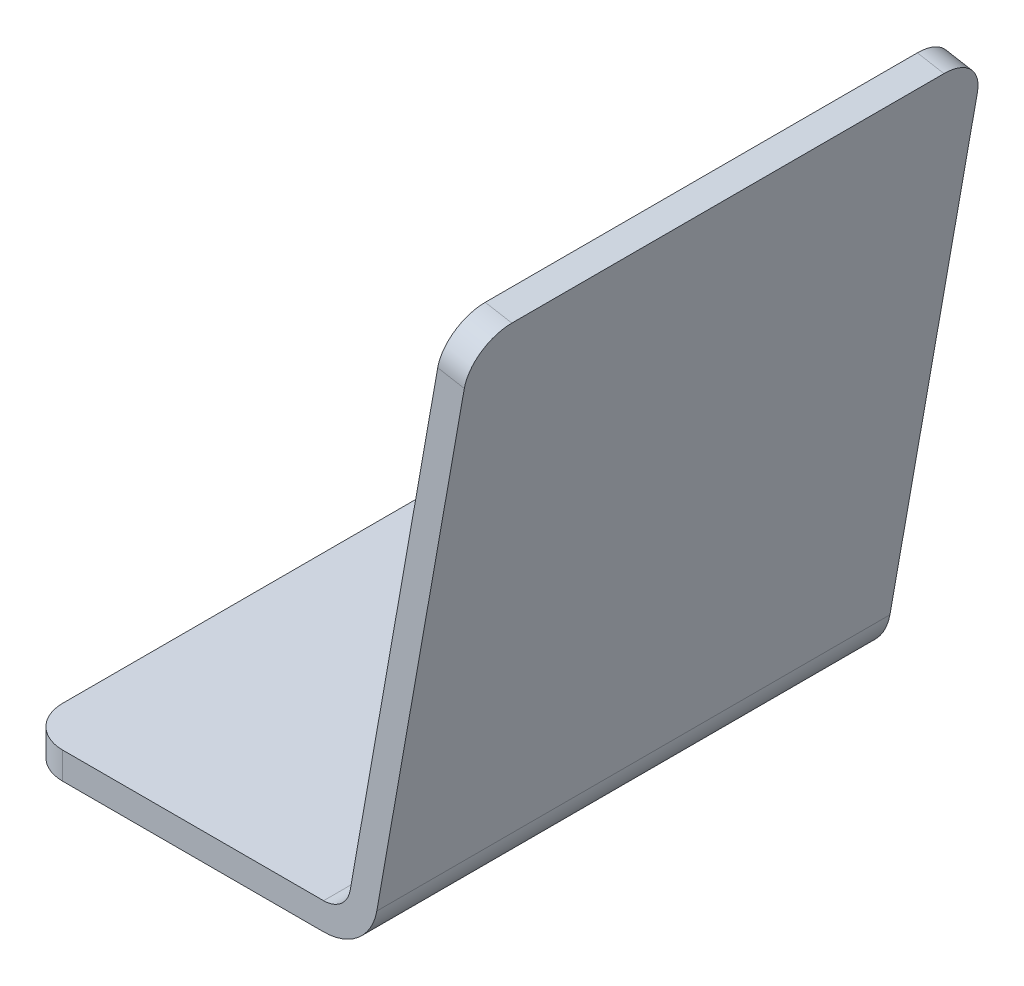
ISO-10303-21;
HEADER;
FILE_DESCRIPTION(('STEP AP214'),'2;1');
FILE_NAME('part.step','',(''),(''),'','','');
FILE_SCHEMA(('AUTOMOTIVE_DESIGN { 1 0 10303 214 1 1 1 1 }'));
ENDSEC;
DATA;
#1=APPLICATION_CONTEXT('core data for automotive mechanical design processes');
#2=APPLICATION_PROTOCOL_DEFINITION('international standard','automotive_design',2000,#1);
#3=PRODUCT_CONTEXT('',#1,'mechanical');
#4=PRODUCT('Part','Part','',(#3));
#5=PRODUCT_RELATED_PRODUCT_CATEGORY('part','',(#4));
#6=PRODUCT_DEFINITION_FORMATION('','',#4);
#7=PRODUCT_DEFINITION_CONTEXT('part definition',#1,'design');
#8=PRODUCT_DEFINITION('design','',#6,#7);
#9=PRODUCT_DEFINITION_SHAPE('','',#8);
#10=(LENGTH_UNIT() NAMED_UNIT(*) SI_UNIT(.MILLI.,.METRE.));
#11=(NAMED_UNIT(*) PLANE_ANGLE_UNIT() SI_UNIT($,.RADIAN.));
#12=(NAMED_UNIT(*) SI_UNIT($,.STERADIAN.) SOLID_ANGLE_UNIT());
#13=UNCERTAINTY_MEASURE_WITH_UNIT(LENGTH_MEASURE(1.E-05),#10,'distance_accuracy_value','');
#14=(GEOMETRIC_REPRESENTATION_CONTEXT(3) GLOBAL_UNCERTAINTY_ASSIGNED_CONTEXT((#13)) GLOBAL_UNIT_ASSIGNED_CONTEXT((#10,
#11,#12)) REPRESENTATION_CONTEXT('',''));
#15=CARTESIAN_POINT('',(0.,0.,0.));
#16=DIRECTION('',(0.,0.,1.));
#17=DIRECTION('',(1.,0.,0.));
#18=AXIS2_PLACEMENT_3D('',#15,#16,#17);
#19=CARTESIAN_POINT('',(26.2610317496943,1.30540728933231,38.));
#20=DIRECTION('',(-0.984807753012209,0.173648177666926,0.));
#21=DIRECTION('',(-0.173648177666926,-0.984807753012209,0.));
#22=AXIS2_PLACEMENT_3D('',#19,#20,#21);
#23=PLANE('',#22);
#24=DIRECTION('',(0.,0.,-1.));
#25=VECTOR('',#24,1.);
#26=CARTESIAN_POINT('',(33.2628389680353,41.0146292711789,38.));
#27=LINE('',#26,#25);
#28=CARTESIAN_POINT('',(33.2628389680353,41.0146292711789,35.));
#29=VERTEX_POINT('',#28);
#30=CARTESIAN_POINT('',(33.2628389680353,41.0146292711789,3.));
#31=VERTEX_POINT('',#30);
#32=EDGE_CURVE('E175',#29,#31,#27,.T.);
#33=ORIENTED_EDGE('',*,*,#32,.F.);
#34=CARTESIAN_POINT('',(32.7418944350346,38.0602060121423,35.));
#35=DIRECTION('',(-0.984807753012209,0.173648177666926,0.));
#36=DIRECTION('',(-0.173648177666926,-0.984807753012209,0.));
#37=AXIS2_PLACEMENT_3D('',#34,#35,#36);
#38=CIRCLE('',#37,3.);
#39=CARTESIAN_POINT('',(32.7418944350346,38.0602060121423,38.));
#40=VERTEX_POINT('',#39);
#41=EDGE_CURVE('E201',#29,#40,#38,.F.);
#42=ORIENTED_EDGE('',*,*,#41,.T.);
#43=DIRECTION('',(0.173648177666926,0.984807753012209,0.));
#44=VECTOR('',#43,1.);
#45=CARTESIAN_POINT('',(26.2610317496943,1.30540728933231,38.));
#46=LINE('',#45,#44);
#47=CARTESIAN_POINT('',(26.2610317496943,1.30540728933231,38.));
#48=VERTEX_POINT('',#47);
#49=EDGE_CURVE('E149',#48,#40,#46,.T.);
#50=ORIENTED_EDGE('',*,*,#49,.F.);
#51=DIRECTION('',(0.,0.,-1.));
#52=VECTOR('',#51,1.);
#53=CARTESIAN_POINT('',(26.2610317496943,1.30540728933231,38.));
#54=LINE('',#53,#52);
#55=CARTESIAN_POINT('',(26.2610317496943,1.30540728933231,0.));
#56=VERTEX_POINT('',#55);
#57=EDGE_CURVE('E161',#48,#56,#54,.T.);
#58=ORIENTED_EDGE('',*,*,#57,.T.);
#59=DIRECTION('',(0.173648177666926,0.984807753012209,0.));
#60=VECTOR('',#59,1.);
#61=CARTESIAN_POINT('',(26.2610317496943,1.30540728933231,0.));
#62=LINE('',#61,#60);
#63=CARTESIAN_POINT('',(32.7418944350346,38.0602060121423,0.));
#64=VERTEX_POINT('',#63);
#65=EDGE_CURVE('E133',#56,#64,#62,.T.);
#66=ORIENTED_EDGE('',*,*,#65,.T.);
#67=CARTESIAN_POINT('',(32.7418944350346,38.0602060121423,3.));
#68=DIRECTION('',(-0.984807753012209,0.173648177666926,0.));
#69=DIRECTION('',(-0.173648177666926,-0.984807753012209,0.));
#70=AXIS2_PLACEMENT_3D('',#67,#68,#69);
#71=CIRCLE('',#70,3.);
#72=EDGE_CURVE('E49',#64,#31,#71,.F.);
#73=ORIENTED_EDGE('',*,*,#72,.T.);
#74=EDGE_LOOP('',(#33,#42,#50,#58,#66,#73));
#75=FACE_BOUND('',#74,.T.);
#76=ADVANCED_FACE('F27',(#75),#23,.F.);
#77=CARTESIAN_POINT('',(31.2932234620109,41.3619256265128,38.));
#78=DIRECTION('',(0.173648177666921,0.98480775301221,0.));
#79=DIRECTION('',(-0.98480775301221,0.173648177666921,0.));
#80=AXIS2_PLACEMENT_3D('',#77,#78,#79);
#81=PLANE('',#80);
#82=DIRECTION('',(0.,0.,-1.));
#83=VECTOR('',#82,1.);
#84=CARTESIAN_POINT('',(31.2932234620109,41.3619256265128,38.));
#85=LINE('',#84,#83);
#86=CARTESIAN_POINT('',(31.2932234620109,41.3619256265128,35.));
#87=VERTEX_POINT('',#86);
#88=CARTESIAN_POINT('',(31.2932234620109,41.3619256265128,3.));
#89=VERTEX_POINT('',#88);
#90=EDGE_CURVE('E127',#87,#89,#85,.T.);
#91=ORIENTED_EDGE('',*,*,#90,.F.);
#92=DIRECTION('',(0.98480775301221,-0.173648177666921,0.));
#93=VECTOR('',#92,1.);
#94=CARTESIAN_POINT('',(31.2932234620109,41.3619256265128,35.));
#95=LINE('',#94,#93);
#96=EDGE_CURVE('E197',#87,#29,#95,.T.);
#97=ORIENTED_EDGE('',*,*,#96,.T.);
#98=ORIENTED_EDGE('',*,*,#32,.T.);
#99=DIRECTION('',(0.98480775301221,-0.173648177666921,0.));
#100=VECTOR('',#99,1.);
#101=CARTESIAN_POINT('',(31.2932234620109,41.3619256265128,3.));
#102=LINE('',#101,#100);
#103=EDGE_CURVE('E195',#31,#89,#102,.F.);
#104=ORIENTED_EDGE('',*,*,#103,.T.);
#105=EDGE_LOOP('',(#91,#97,#98,#104));
#106=FACE_BOUND('',#105,.T.);
#107=ADVANCED_FACE('F226',(#106),#81,.T.);
#108=CARTESIAN_POINT('',(24.2914162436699,1.65270364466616,38.));
#109=DIRECTION('',(-0.984807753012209,0.173648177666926,0.));
#110=DIRECTION('',(-0.173648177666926,-0.984807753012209,0.));
#111=AXIS2_PLACEMENT_3D('',#108,#109,#110);
#112=PLANE('',#111);
#113=DIRECTION('',(0.173648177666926,0.984807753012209,0.));
#114=VECTOR('',#113,1.);
#115=CARTESIAN_POINT('',(24.2914162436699,1.65270364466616,38.));
#116=LINE('',#115,#114);
#117=CARTESIAN_POINT('',(24.2914162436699,1.65270364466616,38.));
#118=VERTEX_POINT('',#117);
#119=CARTESIAN_POINT('',(30.7722789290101,38.4075023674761,38.));
#120=VERTEX_POINT('',#119);
#121=EDGE_CURVE('E152',#118,#120,#116,.T.);
#122=ORIENTED_EDGE('',*,*,#121,.T.);
#123=CARTESIAN_POINT('',(30.7722789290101,38.4075023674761,35.));
#124=DIRECTION('',(-0.984807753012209,0.173648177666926,0.));
#125=DIRECTION('',(-0.173648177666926,-0.984807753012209,0.));
#126=AXIS2_PLACEMENT_3D('',#123,#124,#125);
#127=CIRCLE('',#126,3.);
#128=EDGE_CURVE('E204',#120,#87,#127,.T.);
#129=ORIENTED_EDGE('',*,*,#128,.T.);
#130=ORIENTED_EDGE('',*,*,#90,.T.);
#131=CARTESIAN_POINT('',(30.7722789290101,38.4075023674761,3.));
#132=DIRECTION('',(-0.984807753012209,0.173648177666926,0.));
#133=DIRECTION('',(-0.173648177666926,-0.984807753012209,0.));
#134=AXIS2_PLACEMENT_3D('',#131,#132,#133);
#135=CIRCLE('',#134,3.);
#136=CARTESIAN_POINT('',(30.7722789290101,38.4075023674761,0.));
#137=VERTEX_POINT('',#136);
#138=EDGE_CURVE('E41',#89,#137,#135,.T.);
#139=ORIENTED_EDGE('',*,*,#138,.T.);
#140=DIRECTION('',(0.173648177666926,0.984807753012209,0.));
#141=VECTOR('',#140,1.);
#142=CARTESIAN_POINT('',(24.2914162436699,1.65270364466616,0.));
#143=LINE('',#142,#141);
#144=CARTESIAN_POINT('',(24.2914162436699,1.65270364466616,0.));
#145=VERTEX_POINT('',#144);
#146=EDGE_CURVE('E130',#145,#137,#143,.T.);
#147=ORIENTED_EDGE('',*,*,#146,.F.);
#148=DIRECTION('',(0.,0.,-1.));
#149=VECTOR('',#148,1.);
#150=CARTESIAN_POINT('',(24.2914162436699,1.65270364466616,38.));
#151=LINE('',#150,#149);
#152=EDGE_CURVE('E118',#118,#145,#151,.T.);
#153=ORIENTED_EDGE('',*,*,#152,.F.);
#154=EDGE_LOOP('',(#122,#129,#130,#139,#147,#153));
#155=FACE_BOUND('',#154,.T.);
#156=ADVANCED_FACE('F131',(#155),#112,.T.);
#157=CARTESIAN_POINT('',(22.3218007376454,2.,38.));
#158=DIRECTION('',(0.,0.,-1.));
#159=DIRECTION('',(-1.,0.,0.));
#160=AXIS2_PLACEMENT_3D('',#157,#158,#159);
#161=CYLINDRICAL_SURFACE('',#160,2.);
#162=CARTESIAN_POINT('',(22.3218007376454,2.,0.));
#163=DIRECTION('',(0.,0.,1.));
#164=DIRECTION('',(1.,0.,0.));
#165=AXIS2_PLACEMENT_3D('',#162,#163,#164);
#166=CIRCLE('',#165,2.);
#167=CARTESIAN_POINT('',(22.3218007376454,0.,0.));
#168=VERTEX_POINT('',#167);
#169=EDGE_CURVE('E122',#168,#145,#166,.T.);
#170=ORIENTED_EDGE('',*,*,#169,.F.);
#171=DIRECTION('',(0.,0.,-1.));
#172=VECTOR('',#171,1.);
#173=CARTESIAN_POINT('',(22.3218007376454,0.,38.));
#174=LINE('',#173,#172);
#175=CARTESIAN_POINT('',(22.3218007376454,0.,38.));
#176=VERTEX_POINT('',#175);
#177=EDGE_CURVE('E128',#176,#168,#174,.T.);
#178=ORIENTED_EDGE('',*,*,#177,.F.);
#179=CARTESIAN_POINT('',(22.3218007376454,2.,38.));
#180=DIRECTION('',(0.,0.,1.));
#181=DIRECTION('',(1.,0.,0.));
#182=AXIS2_PLACEMENT_3D('',#179,#180,#181);
#183=CIRCLE('',#182,2.);
#184=EDGE_CURVE('E124',#176,#118,#183,.T.);
#185=ORIENTED_EDGE('',*,*,#184,.T.);
#186=ORIENTED_EDGE('',*,*,#152,.T.);
#187=EDGE_LOOP('',(#170,#178,#185,#186));
#188=FACE_BOUND('',#187,.T.);
#189=ADVANCED_FACE('F119',(#188),#161,.F.);
#190=CARTESIAN_POINT('',(0.,0.,38.));
#191=DIRECTION('',(0.,1.,0.));
#192=DIRECTION('',(-1.,0.,0.));
#193=AXIS2_PLACEMENT_3D('',#190,#191,#192);
#194=PLANE('',#193);
#195=CARTESIAN_POINT('',(13.,0.,19.));
#196=DIRECTION('',(0.,1.,0.));
#197=DIRECTION('',(-1.,0.,0.));
#198=AXIS2_PLACEMENT_3D('',#195,#196,#197);
#199=CIRCLE('',#198,2.60000000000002);
#200=CARTESIAN_POINT('',(10.4,0.,19.));
#201=VERTEX_POINT('',#200);
#202=EDGE_CURVE('E11',#201,#201,#199,.F.);
#203=ORIENTED_EDGE('',*,*,#202,.T.);
#204=EDGE_LOOP('',(#203));
#205=FACE_BOUND('',#204,.T.);
#206=DIRECTION('',(0.,0.,-1.));
#207=VECTOR('',#206,1.);
#208=CARTESIAN_POINT('',(0.,0.,38.));
#209=LINE('',#208,#207);
#210=CARTESIAN_POINT('',(0.,0.,35.));
#211=VERTEX_POINT('',#210);
#212=CARTESIAN_POINT('',(0.,0.,3.));
#213=VERTEX_POINT('',#212);
#214=EDGE_CURVE('E170',#211,#213,#209,.T.);
#215=ORIENTED_EDGE('',*,*,#214,.F.);
#216=CARTESIAN_POINT('',(3.,0.,35.));
#217=DIRECTION('',(0.,1.,0.));
#218=DIRECTION('',(-1.,0.,0.));
#219=AXIS2_PLACEMENT_3D('',#216,#217,#218);
#220=CIRCLE('',#219,3.);
#221=CARTESIAN_POINT('',(3.,0.,38.));
#222=VERTEX_POINT('',#221);
#223=EDGE_CURVE('E185',#211,#222,#220,.T.);
#224=ORIENTED_EDGE('',*,*,#223,.T.);
#225=DIRECTION('',(1.,0.,0.));
#226=VECTOR('',#225,1.);
#227=CARTESIAN_POINT('',(0.,0.,38.));
#228=LINE('',#227,#226);
#229=EDGE_CURVE('E155',#222,#176,#228,.T.);
#230=ORIENTED_EDGE('',*,*,#229,.T.);
#231=ORIENTED_EDGE('',*,*,#177,.T.);
#232=DIRECTION('',(1.,0.,0.));
#233=VECTOR('',#232,1.);
#234=CARTESIAN_POINT('',(0.,0.,0.));
#235=LINE('',#234,#233);
#236=CARTESIAN_POINT('',(3.,0.,0.));
#237=VERTEX_POINT('',#236);
#238=EDGE_CURVE('E139',#237,#168,#235,.T.);
#239=ORIENTED_EDGE('',*,*,#238,.F.);
#240=CARTESIAN_POINT('',(3.,0.,3.));
#241=DIRECTION('',(0.,1.,0.));
#242=DIRECTION('',(-1.,0.,0.));
#243=AXIS2_PLACEMENT_3D('',#240,#241,#242);
#244=CIRCLE('',#243,3.);
#245=EDGE_CURVE('E183',#237,#213,#244,.T.);
#246=ORIENTED_EDGE('',*,*,#245,.T.);
#247=EDGE_LOOP('',(#215,#224,#230,#231,#239,#246));
#248=FACE_BOUND('',#247,.T.);
#249=ADVANCED_FACE('F266',(#205,#248),#194,.T.);
#250=CARTESIAN_POINT('',(0.,-2.,38.));
#251=DIRECTION('',(-1.,0.,0.));
#252=DIRECTION('',(0.,-1.,0.));
#253=AXIS2_PLACEMENT_3D('',#250,#251,#252);
#254=PLANE('',#253);
#255=DIRECTION('',(0.,0.,-1.));
#256=VECTOR('',#255,1.);
#257=CARTESIAN_POINT('',(0.,-2.,38.));
#258=LINE('',#257,#256);
#259=CARTESIAN_POINT('',(0.,-2.,35.));
#260=VERTEX_POINT('',#259);
#261=CARTESIAN_POINT('',(0.,-2.,3.));
#262=VERTEX_POINT('',#261);
#263=EDGE_CURVE('E167',#260,#262,#258,.T.);
#264=ORIENTED_EDGE('',*,*,#263,.F.);
#265=DIRECTION('',(0.,1.,0.));
#266=VECTOR('',#265,1.);
#267=CARTESIAN_POINT('',(0.,-2.,35.));
#268=LINE('',#267,#266);
#269=EDGE_CURVE('E180',#260,#211,#268,.T.);
#270=ORIENTED_EDGE('',*,*,#269,.T.);
#271=ORIENTED_EDGE('',*,*,#214,.T.);
#272=DIRECTION('',(0.,1.,0.));
#273=VECTOR('',#272,1.);
#274=CARTESIAN_POINT('',(0.,-2.,3.));
#275=LINE('',#274,#273);
#276=EDGE_CURVE('E178',#213,#262,#275,.F.);
#277=ORIENTED_EDGE('',*,*,#276,.T.);
#278=EDGE_LOOP('',(#264,#270,#271,#277));
#279=FACE_BOUND('',#278,.T.);
#280=ADVANCED_FACE('F250',(#279),#254,.T.);
#281=CARTESIAN_POINT('',(0.,-2.,38.));
#282=DIRECTION('',(0.,1.,0.));
#283=DIRECTION('',(-1.,0.,0.));
#284=AXIS2_PLACEMENT_3D('',#281,#282,#283);
#285=PLANE('',#284);
#286=CARTESIAN_POINT('',(13.,-2.,19.));
#287=DIRECTION('',(0.,1.,0.));
#288=DIRECTION('',(-1.,0.,0.));
#289=AXIS2_PLACEMENT_3D('',#286,#287,#288);
#290=CIRCLE('',#289,1.6);
#291=CARTESIAN_POINT('',(11.4,-2.,19.));
#292=VERTEX_POINT('',#291);
#293=EDGE_CURVE('E241',#292,#292,#290,.T.);
#294=ORIENTED_EDGE('',*,*,#293,.T.);
#295=EDGE_LOOP('',(#294));
#296=FACE_BOUND('',#295,.T.);
#297=DIRECTION('',(1.,0.,0.));
#298=VECTOR('',#297,1.);
#299=CARTESIAN_POINT('',(0.,-2.,38.));
#300=LINE('',#299,#298);
#301=CARTESIAN_POINT('',(3.,-2.,38.));
#302=VERTEX_POINT('',#301);
#303=CARTESIAN_POINT('',(22.3218007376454,-2.,38.));
#304=VERTEX_POINT('',#303);
#305=EDGE_CURVE('E157',#302,#304,#300,.T.);
#306=ORIENTED_EDGE('',*,*,#305,.F.);
#307=CARTESIAN_POINT('',(3.,-2.,35.));
#308=DIRECTION('',(0.,1.,0.));
#309=DIRECTION('',(-1.,0.,0.));
#310=AXIS2_PLACEMENT_3D('',#307,#308,#309);
#311=CIRCLE('',#310,3.);
#312=EDGE_CURVE('E193',#302,#260,#311,.F.);
#313=ORIENTED_EDGE('',*,*,#312,.T.);
#314=ORIENTED_EDGE('',*,*,#263,.T.);
#315=CARTESIAN_POINT('',(3.,-2.,3.));
#316=DIRECTION('',(0.,1.,0.));
#317=DIRECTION('',(-1.,0.,0.));
#318=AXIS2_PLACEMENT_3D('',#315,#316,#317);
#319=CIRCLE('',#318,3.);
#320=CARTESIAN_POINT('',(3.,-2.,0.));
#321=VERTEX_POINT('',#320);
#322=EDGE_CURVE('E191',#262,#321,#319,.F.);
#323=ORIENTED_EDGE('',*,*,#322,.T.);
#324=DIRECTION('',(1.,0.,0.));
#325=VECTOR('',#324,1.);
#326=CARTESIAN_POINT('',(0.,-2.,0.));
#327=LINE('',#326,#325);
#328=CARTESIAN_POINT('',(22.3218007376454,-2.,0.));
#329=VERTEX_POINT('',#328);
#330=EDGE_CURVE('E142',#321,#329,#327,.T.);
#331=ORIENTED_EDGE('',*,*,#330,.T.);
#332=DIRECTION('',(0.,0.,-1.));
#333=VECTOR('',#332,1.);
#334=CARTESIAN_POINT('',(22.3218007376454,-2.,38.));
#335=LINE('',#334,#333);
#336=EDGE_CURVE('E164',#304,#329,#335,.T.);
#337=ORIENTED_EDGE('',*,*,#336,.F.);
#338=EDGE_LOOP('',(#306,#313,#314,#323,#331,#337));
#339=FACE_BOUND('',#338,.T.);
#340=ADVANCED_FACE('F246',(#296,#339),#285,.F.);
#341=CARTESIAN_POINT('',(22.3218007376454,2.,38.));
#342=DIRECTION('',(0.,0.,-1.));
#343=DIRECTION('',(-1.,0.,0.));
#344=AXIS2_PLACEMENT_3D('',#341,#342,#343);
#345=CYLINDRICAL_SURFACE('',#344,4.);
#346=CARTESIAN_POINT('',(22.3218007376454,2.,0.));
#347=DIRECTION('',(0.,0.,1.));
#348=DIRECTION('',(1.,0.,0.));
#349=AXIS2_PLACEMENT_3D('',#346,#347,#348);
#350=CIRCLE('',#349,4.);
#351=EDGE_CURVE('E147',#329,#56,#350,.T.);
#352=ORIENTED_EDGE('',*,*,#351,.T.);
#353=ORIENTED_EDGE('',*,*,#57,.F.);
#354=CARTESIAN_POINT('',(22.3218007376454,2.,38.));
#355=DIRECTION('',(0.,0.,1.));
#356=DIRECTION('',(1.,0.,0.));
#357=AXIS2_PLACEMENT_3D('',#354,#355,#356);
#358=CIRCLE('',#357,4.);
#359=EDGE_CURVE('E159',#304,#48,#358,.T.);
#360=ORIENTED_EDGE('',*,*,#359,.F.);
#361=ORIENTED_EDGE('',*,*,#336,.T.);
#362=EDGE_LOOP('',(#352,#353,#360,#361));
#363=FACE_BOUND('',#362,.T.);
#364=ADVANCED_FACE('F249',(#363),#345,.T.);
#365=CARTESIAN_POINT('',(22.3218007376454,2.,38.));
#366=DIRECTION('',(0.,0.,1.));
#367=DIRECTION('',(1.,0.,0.));
#368=AXIS2_PLACEMENT_3D('',#365,#366,#367);
#369=PLANE('',#368);
#370=ORIENTED_EDGE('',*,*,#229,.F.);
#371=DIRECTION('',(0.,1.,0.));
#372=VECTOR('',#371,1.);
#373=CARTESIAN_POINT('',(3.,2.,38.));
#374=LINE('',#373,#372);
#375=EDGE_CURVE('E189',#222,#302,#374,.F.);
#376=ORIENTED_EDGE('',*,*,#375,.T.);
#377=ORIENTED_EDGE('',*,*,#305,.T.);
#378=ORIENTED_EDGE('',*,*,#359,.T.);
#379=ORIENTED_EDGE('',*,*,#49,.T.);
#380=DIRECTION('',(0.98480775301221,-0.173648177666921,0.));
#381=VECTOR('',#380,1.);
#382=CARTESIAN_POINT('',(28.8026634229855,38.75479872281,38.));
#383=LINE('',#382,#381);
#384=EDGE_CURVE('E187',#40,#120,#383,.F.);
#385=ORIENTED_EDGE('',*,*,#384,.T.);
#386=ORIENTED_EDGE('',*,*,#121,.F.);
#387=ORIENTED_EDGE('',*,*,#184,.F.);
#388=EDGE_LOOP('',(#370,#376,#377,#378,#379,#385,#386,#387));
#389=FACE_BOUND('',#388,.T.);
#390=ADVANCED_FACE('F273',(#389),#369,.T.);
#391=CARTESIAN_POINT('',(22.3218007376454,2.,0.));
#392=DIRECTION('',(0.,0.,1.));
#393=DIRECTION('',(1.,0.,0.));
#394=AXIS2_PLACEMENT_3D('',#391,#392,#393);
#395=PLANE('',#394);
#396=ORIENTED_EDGE('',*,*,#330,.F.);
#397=DIRECTION('',(0.,1.,0.));
#398=VECTOR('',#397,1.);
#399=CARTESIAN_POINT('',(3.,0.,0.));
#400=LINE('',#399,#398);
#401=EDGE_CURVE('E208',#321,#237,#400,.T.);
#402=ORIENTED_EDGE('',*,*,#401,.T.);
#403=ORIENTED_EDGE('',*,*,#238,.T.);
#404=ORIENTED_EDGE('',*,*,#169,.T.);
#405=ORIENTED_EDGE('',*,*,#146,.T.);
#406=DIRECTION('',(0.98480775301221,-0.173648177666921,0.));
#407=VECTOR('',#406,1.);
#408=CARTESIAN_POINT('',(32.7418944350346,38.0602060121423,0.));
#409=LINE('',#408,#407);
#410=EDGE_CURVE('E206',#137,#64,#409,.T.);
#411=ORIENTED_EDGE('',*,*,#410,.T.);
#412=ORIENTED_EDGE('',*,*,#65,.F.);
#413=ORIENTED_EDGE('',*,*,#351,.F.);
#414=EDGE_LOOP('',(#396,#402,#403,#404,#405,#411,#412,#413));
#415=FACE_BOUND('',#414,.T.);
#416=ADVANCED_FACE('F136',(#415),#395,.F.);
#417=CARTESIAN_POINT('',(3.,-2.,35.));
#418=DIRECTION('',(0.,1.,0.));
#419=DIRECTION('',(-1.,0.,0.));
#420=AXIS2_PLACEMENT_3D('',#417,#418,#419);
#421=CYLINDRICAL_SURFACE('',#420,3.);
#422=ORIENTED_EDGE('',*,*,#312,.F.);
#423=ORIENTED_EDGE('',*,*,#375,.F.);
#424=ORIENTED_EDGE('',*,*,#223,.F.);
#425=ORIENTED_EDGE('',*,*,#269,.F.);
#426=EDGE_LOOP('',(#422,#423,#424,#425));
#427=FACE_BOUND('',#426,.T.);
#428=ADVANCED_FACE('F261',(#427),#421,.T.);
#429=CARTESIAN_POINT('',(30.7722789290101,38.4075023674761,35.));
#430=DIRECTION('',(0.98480775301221,-0.173648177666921,0.));
#431=DIRECTION('',(0.173648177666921,0.98480775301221,0.));
#432=AXIS2_PLACEMENT_3D('',#429,#430,#431);
#433=CYLINDRICAL_SURFACE('',#432,3.);
#434=ORIENTED_EDGE('',*,*,#128,.F.);
#435=ORIENTED_EDGE('',*,*,#384,.F.);
#436=ORIENTED_EDGE('',*,*,#41,.F.);
#437=ORIENTED_EDGE('',*,*,#96,.F.);
#438=EDGE_LOOP('',(#434,#435,#436,#437));
#439=FACE_BOUND('',#438,.T.);
#440=ADVANCED_FACE('F277',(#439),#433,.T.);
#441=CARTESIAN_POINT('',(3.,2.,3.));
#442=DIRECTION('',(0.,-1.,0.));
#443=DIRECTION('',(1.,0.,0.));
#444=AXIS2_PLACEMENT_3D('',#441,#442,#443);
#445=CYLINDRICAL_SURFACE('',#444,3.);
#446=ORIENTED_EDGE('',*,*,#322,.F.);
#447=ORIENTED_EDGE('',*,*,#276,.F.);
#448=ORIENTED_EDGE('',*,*,#245,.F.);
#449=ORIENTED_EDGE('',*,*,#401,.F.);
#450=EDGE_LOOP('',(#446,#447,#448,#449));
#451=FACE_BOUND('',#450,.T.);
#452=ADVANCED_FACE('F271',(#451),#445,.T.);
#453=CARTESIAN_POINT('',(28.8026634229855,38.75479872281,3.));
#454=DIRECTION('',(-0.98480775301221,0.173648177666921,0.));
#455=DIRECTION('',(-0.173648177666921,-0.98480775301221,0.));
#456=AXIS2_PLACEMENT_3D('',#453,#454,#455);
#457=CYLINDRICAL_SURFACE('',#456,3.);
#458=ORIENTED_EDGE('',*,*,#138,.F.);
#459=ORIENTED_EDGE('',*,*,#103,.F.);
#460=ORIENTED_EDGE('',*,*,#72,.F.);
#461=ORIENTED_EDGE('',*,*,#410,.F.);
#462=EDGE_LOOP('',(#458,#459,#460,#461));
#463=FACE_BOUND('',#462,.T.);
#464=ADVANCED_FACE('F222',(#463),#457,.T.);
#465=CARTESIAN_POINT('',(13.,-2.,19.));
#466=DIRECTION('',(0.,1.,0.));
#467=DIRECTION('',(-1.,0.,0.));
#468=AXIS2_PLACEMENT_3D('',#465,#466,#467);
#469=CYLINDRICAL_SURFACE('',#468,1.6);
#470=CARTESIAN_POINT('',(13.,-0.57735026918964,19.));
#471=DIRECTION('',(0.,1.,0.));
#472=DIRECTION('',(0.,0.,1.));
#473=AXIS2_PLACEMENT_3D('',#470,#471,#472);
#474=CIRCLE('',#473,1.6);
#475=CARTESIAN_POINT('',(13.,-0.57735026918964,20.6));
#476=VERTEX_POINT('',#475);
#477=EDGE_CURVE('E34',#476,#476,#474,.T.);
#478=ORIENTED_EDGE('',*,*,#477,.T.);
#479=EDGE_LOOP('',(#478));
#480=FACE_BOUND('',#479,.T.);
#481=ORIENTED_EDGE('',*,*,#293,.F.);
#482=EDGE_LOOP('',(#481));
#483=FACE_BOUND('',#482,.T.);
#484=ADVANCED_FACE('F212',(#480,#483),#469,.F.);
#485=CARTESIAN_POINT('',(13.,-0.57735026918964,19.));
#486=DIRECTION('',(0.,1.,0.));
#487=DIRECTION('',(0.,0.,1.));
#488=AXIS2_PLACEMENT_3D('',#485,#486,#487);
#489=CONICAL_SURFACE('',#488,1.6,1.04719755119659);
#490=ORIENTED_EDGE('',*,*,#202,.F.);
#491=EDGE_LOOP('',(#490));
#492=FACE_BOUND('',#491,.T.);
#493=ORIENTED_EDGE('',*,*,#477,.F.);
#494=EDGE_LOOP('',(#493));
#495=FACE_BOUND('',#494,.T.);
#496=ADVANCED_FACE('F215',(#492,#495),#489,.F.);
#497=CLOSED_SHELL('',(#76,#107,#156,#189,#249,#280,#340,#364,#390,#416,#428,#440,#452,#464,#484,#496));
#498=MANIFOLD_SOLID_BREP('B2',#497);
#499=ADVANCED_BREP_SHAPE_REPRESENTATION('',(#18,#498),#14);
#500=SHAPE_DEFINITION_REPRESENTATION(#9,#499);
ENDSEC;
END-ISO-10303-21;
